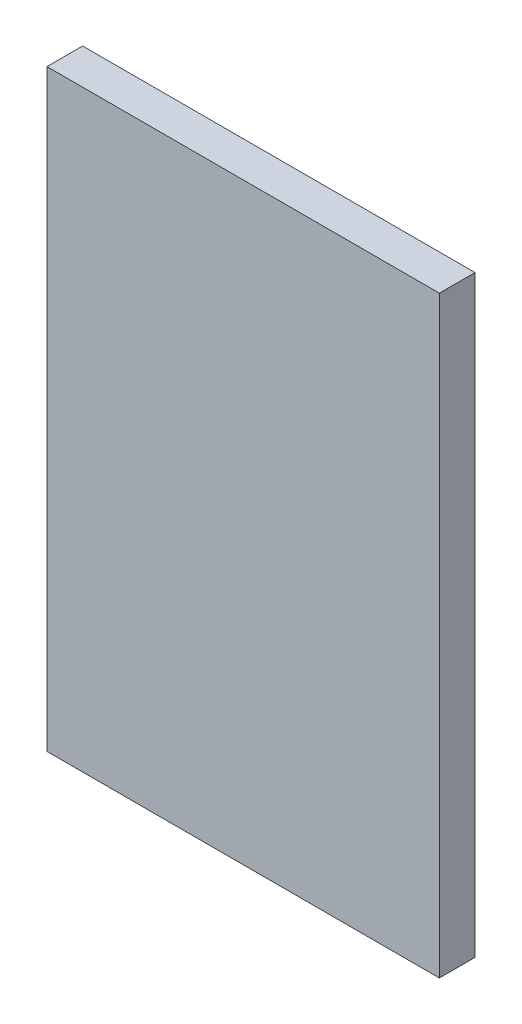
from build123d import *

# Parameters (mm, degrees)
SKETCH_1_W      = 176
SKETCH_1_H      = 266
EXTRUDE_1_DEPTH = 16


with BuildPart() as part:
    # Sketch 1 → Extrude 1 (new body)
    with BuildSketch(Plane.XY):
        Rectangle(SKETCH_1_W, SKETCH_1_H)
    extrude(amount=EXTRUDE_1_DEPTH)


solid = part.part
